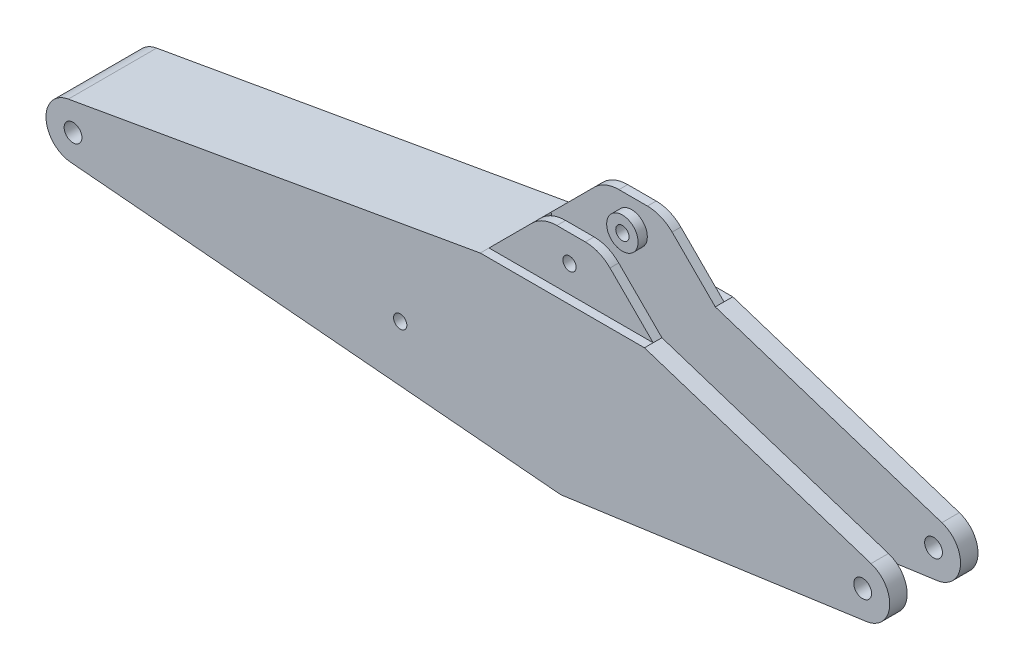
ISO-10303-21;
HEADER;
FILE_DESCRIPTION(('STEP AP214'),'2;1');
FILE_NAME('part.step','',(''),(''),'','','');
FILE_SCHEMA(('AUTOMOTIVE_DESIGN { 1 0 10303 214 1 1 1 1 }'));
ENDSEC;
DATA;
#1=APPLICATION_CONTEXT('core data for automotive mechanical design processes');
#2=APPLICATION_PROTOCOL_DEFINITION('international standard','automotive_design',2000,#1);
#3=PRODUCT_CONTEXT('',#1,'mechanical');
#4=PRODUCT('Part','Part','',(#3));
#5=PRODUCT_RELATED_PRODUCT_CATEGORY('part','',(#4));
#6=PRODUCT_DEFINITION_FORMATION('','',#4);
#7=PRODUCT_DEFINITION_CONTEXT('part definition',#1,'design');
#8=PRODUCT_DEFINITION('design','',#6,#7);
#9=PRODUCT_DEFINITION_SHAPE('','',#8);
#10=(LENGTH_UNIT() NAMED_UNIT(*) SI_UNIT(.MILLI.,.METRE.));
#11=(NAMED_UNIT(*) PLANE_ANGLE_UNIT() SI_UNIT($,.RADIAN.));
#12=(NAMED_UNIT(*) SI_UNIT($,.STERADIAN.) SOLID_ANGLE_UNIT());
#13=UNCERTAINTY_MEASURE_WITH_UNIT(LENGTH_MEASURE(1.E-05),#10,'distance_accuracy_value','');
#14=(GEOMETRIC_REPRESENTATION_CONTEXT(3) GLOBAL_UNCERTAINTY_ASSIGNED_CONTEXT((#13)) GLOBAL_UNIT_ASSIGNED_CONTEXT((#10,
#11,#12)) REPRESENTATION_CONTEXT('',''));
#15=CARTESIAN_POINT('',(0.,0.,0.));
#16=DIRECTION('',(0.,0.,1.));
#17=DIRECTION('',(1.,0.,0.));
#18=AXIS2_PLACEMENT_3D('',#15,#16,#17);
#19=CARTESIAN_POINT('',(524.272543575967,524.272543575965,253.));
#20=DIRECTION('',(-0.707106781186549,-0.707106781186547,0.));
#21=DIRECTION('',(0.707106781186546,-0.707106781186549,0.));
#22=AXIS2_PLACEMENT_3D('',#19,#20,#21);
#23=PLANE('',#22);
#24=DIRECTION('',(0.707106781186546,-0.707106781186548,0.));
#25=VECTOR('',#24,1.);
#26=CARTESIAN_POINT('',(479.545087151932,569.,203.));
#27=LINE('',#26,#25);
#28=CARTESIAN_POINT('',(232.123730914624,816.421356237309,203.));
#29=VERTEX_POINT('',#28);
#30=CARTESIAN_POINT('',(479.545087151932,569.,203.));
#31=VERTEX_POINT('',#30);
#32=EDGE_CURVE('E53',#29,#31,#27,.T.);
#33=ORIENTED_EDGE('',*,*,#32,.T.);
#34=DIRECTION('',(0.,0.,-1.));
#35=VECTOR('',#34,1.);
#36=CARTESIAN_POINT('',(479.545087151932,569.,253.));
#37=LINE('',#36,#35);
#38=CARTESIAN_POINT('',(479.545087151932,569.,153.));
#39=VERTEX_POINT('',#38);
#40=EDGE_CURVE('E299',#31,#39,#37,.T.);
#41=ORIENTED_EDGE('',*,*,#40,.T.);
#42=DIRECTION('',(-0.707106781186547,0.707106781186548,0.));
#43=VECTOR('',#42,1.);
#44=CARTESIAN_POINT('',(524.272543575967,524.272543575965,153.));
#45=LINE('',#44,#43);
#46=CARTESIAN_POINT('',(232.123730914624,816.421356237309,153.));
#47=VERTEX_POINT('',#46);
#48=EDGE_CURVE('E287',#39,#47,#45,.T.);
#49=ORIENTED_EDGE('',*,*,#48,.T.);
#50=DIRECTION('',(0.,0.,-1.));
#51=VECTOR('',#50,1.);
#52=CARTESIAN_POINT('',(232.123730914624,816.421356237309,253.));
#53=LINE('',#52,#51);
#54=EDGE_CURVE('E242',#47,#29,#53,.F.);
#55=ORIENTED_EDGE('',*,*,#54,.T.);
#56=EDGE_LOOP('',(#33,#41,#49,#55));
#57=FACE_BOUND('',#56,.T.);
#58=ADVANCED_FACE('F37',(#57),#23,.F.);
#59=CARTESIAN_POINT('',(0.,875.,253.));
#60=DIRECTION('',(0.,-1.,0.));
#61=DIRECTION('',(0.,0.,-1.));
#62=AXIS2_PLACEMENT_3D('',#59,#60,#61);
#63=PLANE('',#62);
#64=DIRECTION('',(1.,0.,0.));
#65=VECTOR('',#64,1.);
#66=CARTESIAN_POINT('',(90.7023746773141,875.,203.));
#67=LINE('',#66,#65);
#68=CARTESIAN_POINT('',(-72.4067972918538,875.,203.));
#69=VERTEX_POINT('',#68);
#70=CARTESIAN_POINT('',(90.7023746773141,875.,203.));
#71=VERTEX_POINT('',#70);
#72=EDGE_CURVE('E219',#69,#71,#67,.T.);
#73=ORIENTED_EDGE('',*,*,#72,.T.);
#74=DIRECTION('',(0.,0.,-1.));
#75=VECTOR('',#74,1.);
#76=CARTESIAN_POINT('',(90.7023746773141,875.,253.));
#77=LINE('',#76,#75);
#78=CARTESIAN_POINT('',(90.7023746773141,875.,153.));
#79=VERTEX_POINT('',#78);
#80=EDGE_CURVE('E61',#71,#79,#77,.T.);
#81=ORIENTED_EDGE('',*,*,#80,.T.);
#82=DIRECTION('',(-1.,0.,0.));
#83=VECTOR('',#82,1.);
#84=CARTESIAN_POINT('',(0.,875.,153.));
#85=LINE('',#84,#83);
#86=CARTESIAN_POINT('',(-72.4067972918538,875.,153.));
#87=VERTEX_POINT('',#86);
#88=EDGE_CURVE('E485',#79,#87,#85,.T.);
#89=ORIENTED_EDGE('',*,*,#88,.T.);
#90=DIRECTION('',(0.,0.,-1.));
#91=VECTOR('',#90,1.);
#92=CARTESIAN_POINT('',(-72.4067972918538,875.,253.));
#93=LINE('',#92,#91);
#94=EDGE_CURVE('E228',#87,#69,#93,.F.);
#95=ORIENTED_EDGE('',*,*,#94,.T.);
#96=EDGE_LOOP('',(#73,#81,#89,#95));
#97=FACE_BOUND('',#96,.T.);
#98=ADVANCED_FACE('F226',(#97),#63,.F.);
#99=CARTESIAN_POINT('',(-515.124754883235,515.124754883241,253.));
#100=DIRECTION('',(0.707106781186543,-0.707106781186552,0.));
#101=DIRECTION('',(0.707106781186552,0.707106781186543,0.));
#102=AXIS2_PLACEMENT_3D('',#99,#100,#101);
#103=PLANE('',#102);
#104=DIRECTION('',(0.707106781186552,0.707106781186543,0.));
#105=VECTOR('',#104,1.);
#106=CARTESIAN_POINT('',(-213.828153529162,816.42135623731,203.));
#107=LINE('',#106,#105);
#108=CARTESIAN_POINT('',(-461.249509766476,569.,203.));
#109=VERTEX_POINT('',#108);
#110=CARTESIAN_POINT('',(-213.828153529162,816.42135623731,203.));
#111=VERTEX_POINT('',#110);
#112=EDGE_CURVE('E539',#109,#111,#107,.T.);
#113=ORIENTED_EDGE('',*,*,#112,.T.);
#114=DIRECTION('',(0.,0.,-1.));
#115=VECTOR('',#114,1.);
#116=CARTESIAN_POINT('',(-213.828153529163,816.42135623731,253.));
#117=LINE('',#116,#115);
#118=CARTESIAN_POINT('',(-213.828153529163,816.42135623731,153.));
#119=VERTEX_POINT('',#118);
#120=EDGE_CURVE('E238',#111,#119,#117,.T.);
#121=ORIENTED_EDGE('',*,*,#120,.T.);
#122=DIRECTION('',(-0.707106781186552,-0.707106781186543,0.));
#123=VECTOR('',#122,1.);
#124=CARTESIAN_POINT('',(-515.124754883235,515.124754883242,153.));
#125=LINE('',#124,#123);
#126=CARTESIAN_POINT('',(-461.249509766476,569.,153.));
#127=VERTEX_POINT('',#126);
#128=EDGE_CURVE('E490',#119,#127,#125,.T.);
#129=ORIENTED_EDGE('',*,*,#128,.T.);
#130=DIRECTION('',(0.,0.,-1.));
#131=VECTOR('',#130,1.);
#132=CARTESIAN_POINT('',(-461.249509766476,569.,253.));
#133=LINE('',#132,#131);
#134=EDGE_CURVE('E396',#109,#127,#133,.T.);
#135=ORIENTED_EDGE('',*,*,#134,.F.);
#136=EDGE_LOOP('',(#113,#121,#129,#135));
#137=FACE_BOUND('',#136,.T.);
#138=ADVANCED_FACE('F536',(#137),#103,.F.);
#139=CARTESIAN_POINT('',(0.,0.,253.));
#140=DIRECTION('',(0.,0.,1.));
#141=DIRECTION('',(1.,0.,0.));
#142=AXIS2_PLACEMENT_3D('',#139,#140,#141);
#143=PLANE('',#142);
#144=CARTESIAN_POINT('',(-919.999999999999,0.,253.));
#145=DIRECTION('',(0.,0.,1.));
#146=DIRECTION('',(1.,0.,0.));
#147=AXIS2_PLACEMENT_3D('',#144,#145,#146);
#148=CIRCLE('',#147,38.);
#149=CARTESIAN_POINT('',(-881.999999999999,0.,253.));
#150=VERTEX_POINT('',#149);
#151=EDGE_CURVE('E687',#150,#150,#148,.T.);
#152=ORIENTED_EDGE('',*,*,#151,.F.);
#153=EDGE_LOOP('',(#152));
#154=FACE_BOUND('',#153,.T.);
#155=CARTESIAN_POINT('',(1730.,0.,253.));
#156=DIRECTION('',(0.,0.,1.));
#157=DIRECTION('',(1.,0.,0.));
#158=AXIS2_PLACEMENT_3D('',#155,#156,#157);
#159=CIRCLE('',#158,51.0000000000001);
#160=CARTESIAN_POINT('',(1781.,0.,253.));
#161=VERTEX_POINT('',#160);
#162=EDGE_CURVE('E360',#161,#161,#159,.T.);
#163=ORIENTED_EDGE('',*,*,#162,.F.);
#164=EDGE_LOOP('',(#163));
#165=FACE_BOUND('',#164,.T.);
#166=CARTESIAN_POINT('',(-2795.,0.,253.));
#167=DIRECTION('',(0.,0.,1.));
#168=DIRECTION('',(1.,0.,0.));
#169=AXIS2_PLACEMENT_3D('',#166,#167,#168);
#170=CIRCLE('',#169,51.0000000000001);
#171=CARTESIAN_POINT('',(-2744.,0.,253.));
#172=VERTEX_POINT('',#171);
#173=EDGE_CURVE('E357',#172,#172,#170,.T.);
#174=ORIENTED_EDGE('',*,*,#173,.F.);
#175=EDGE_LOOP('',(#174));
#176=FACE_BOUND('',#175,.T.);
#177=DIRECTION('',(-0.951115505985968,0.308835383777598,0.));
#178=VECTOR('',#177,1.);
#179=CARTESIAN_POINT('',(212.875663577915,655.589855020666,253.));
#180=LINE('',#179,#178);
#181=CARTESIAN_POINT('',(1777.86948448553,147.422903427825,253.));
#182=VERTEX_POINT('',#181);
#183=CARTESIAN_POINT('',(479.545087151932,569.,253.));
#184=VERTEX_POINT('',#183);
#185=EDGE_CURVE('E347',#182,#184,#180,.T.);
#186=ORIENTED_EDGE('',*,*,#185,.T.);
#187=DIRECTION('',(-1.,0.,0.));
#188=VECTOR('',#187,1.);
#189=CARTESIAN_POINT('',(479.545087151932,569.,253.));
#190=LINE('',#189,#188);
#191=CARTESIAN_POINT('',(-461.249509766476,569.,253.));
#192=VERTEX_POINT('',#191);
#193=EDGE_CURVE('E546',#184,#192,#190,.T.);
#194=ORIENTED_EDGE('',*,*,#193,.T.);
#195=DIRECTION('',(0.984800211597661,0.173690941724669,0.));
#196=VECTOR('',#195,1.);
#197=CARTESIAN_POINT('',(-111.243174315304,630.731231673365,253.));
#198=LINE('',#197,#196);
#199=CARTESIAN_POINT('',(-2821.92209596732,152.644032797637,253.));
#200=VERTEX_POINT('',#199);
#201=EDGE_CURVE('E350',#200,#192,#198,.T.);
#202=ORIENTED_EDGE('',*,*,#201,.F.);
#203=CARTESIAN_POINT('',(-2795.,0.,253.));
#204=DIRECTION('',(0.,0.,1.));
#205=DIRECTION('',(1.,0.,0.));
#206=AXIS2_PLACEMENT_3D('',#203,#204,#205);
#207=CIRCLE('',#206,155.);
#208=CARTESIAN_POINT('',(-2808.50243501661,-154.410764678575,253.));
#209=VERTEX_POINT('',#208);
#210=EDGE_CURVE('E353',#200,#209,#207,.T.);
#211=ORIENTED_EDGE('',*,*,#210,.T.);
#212=DIRECTION('',(0.996198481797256,-0.0871124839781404,0.));
#213=VECTOR('',#212,1.);
#214=CARTESIAN_POINT('',(-34.7125297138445,-396.964566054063,253.));
#215=LINE('',#214,#213);
#216=CARTESIAN_POINT('',(0.,-400.,253.));
#217=VERTEX_POINT('',#216);
#218=EDGE_CURVE('E355',#209,#217,#215,.T.);
#219=ORIENTED_EDGE('',*,*,#218,.T.);
#220=DIRECTION('',(0.990241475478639,0.139362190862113,0.));
#221=VECTOR('',#220,1.);
#222=CARTESIAN_POINT('',(55.2008886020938,-392.231271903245,253.));
#223=LINE('',#222,#221);
#224=CARTESIAN_POINT('',(1751.60113958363,-153.487428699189,253.));
#225=VERTEX_POINT('',#224);
#226=EDGE_CURVE('E341',#217,#225,#223,.T.);
#227=ORIENTED_EDGE('',*,*,#226,.T.);
#228=CARTESIAN_POINT('',(1730.,0.,253.));
#229=DIRECTION('',(0.,0.,1.));
#230=DIRECTION('',(1.,0.,0.));
#231=AXIS2_PLACEMENT_3D('',#228,#229,#230);
#232=CIRCLE('',#231,155.);
#233=EDGE_CURVE('E344',#225,#182,#232,.T.);
#234=ORIENTED_EDGE('',*,*,#233,.T.);
#235=EDGE_LOOP('',(#186,#194,#202,#211,#219,#227,#234));
#236=FACE_BOUND('',#235,.T.);
#237=ADVANCED_FACE('F739',(#154,#165,#176,#236),#143,.T.);
#238=CARTESIAN_POINT('',(-72.4067972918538,675.,253.));
#239=DIRECTION('',(0.,0.,-1.));
#240=DIRECTION('',(-1.,0.,0.));
#241=AXIS2_PLACEMENT_3D('',#238,#239,#240);
#242=CYLINDRICAL_SURFACE('',#241,200.);
#243=ORIENTED_EDGE('',*,*,#120,.F.);
#244=CARTESIAN_POINT('',(-72.4067972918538,675.,203.));
#245=DIRECTION('',(0.,0.,-1.));
#246=DIRECTION('',(-1.,0.,0.));
#247=AXIS2_PLACEMENT_3D('',#244,#245,#246);
#248=CIRCLE('',#247,200.);
#249=EDGE_CURVE('E229',#111,#69,#248,.T.);
#250=ORIENTED_EDGE('',*,*,#249,.T.);
#251=ORIENTED_EDGE('',*,*,#94,.F.);
#252=CARTESIAN_POINT('',(-72.4067972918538,675.,153.));
#253=DIRECTION('',(0.,0.,1.));
#254=DIRECTION('',(1.,0.,0.));
#255=AXIS2_PLACEMENT_3D('',#252,#253,#254);
#256=CIRCLE('',#255,200.);
#257=EDGE_CURVE('E487',#87,#119,#256,.T.);
#258=ORIENTED_EDGE('',*,*,#257,.T.);
#259=EDGE_LOOP('',(#243,#250,#251,#258));
#260=FACE_BOUND('',#259,.T.);
#261=ADVANCED_FACE('F541',(#260),#242,.T.);
#262=CARTESIAN_POINT('',(90.7023746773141,675.,253.));
#263=DIRECTION('',(0.,0.,-1.));
#264=DIRECTION('',(-1.,0.,0.));
#265=AXIS2_PLACEMENT_3D('',#262,#263,#264);
#266=CYLINDRICAL_SURFACE('',#265,200.);
#267=ORIENTED_EDGE('',*,*,#80,.F.);
#268=CARTESIAN_POINT('',(90.7023746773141,675.,203.));
#269=DIRECTION('',(0.,0.,-1.));
#270=DIRECTION('',(-1.,0.,0.));
#271=AXIS2_PLACEMENT_3D('',#268,#269,#270);
#272=CIRCLE('',#271,200.);
#273=EDGE_CURVE('E216',#71,#29,#272,.T.);
#274=ORIENTED_EDGE('',*,*,#273,.T.);
#275=ORIENTED_EDGE('',*,*,#54,.F.);
#276=CARTESIAN_POINT('',(90.7023746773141,675.,153.));
#277=DIRECTION('',(0.,0.,1.));
#278=DIRECTION('',(1.,0.,0.));
#279=AXIS2_PLACEMENT_3D('',#276,#277,#278);
#280=CIRCLE('',#279,200.);
#281=EDGE_CURVE('E232',#47,#79,#280,.T.);
#282=ORIENTED_EDGE('',*,*,#281,.T.);
#283=EDGE_LOOP('',(#267,#274,#275,#282));
#284=FACE_BOUND('',#283,.T.);
#285=ADVANCED_FACE('F39',(#284),#266,.T.);
#286=CARTESIAN_POINT('',(0.,722.,253.));
#287=DIRECTION('',(0.,0.,-1.));
#288=DIRECTION('',(-1.,0.,0.));
#289=AXIS2_PLACEMENT_3D('',#286,#287,#288);
#290=CYLINDRICAL_SURFACE('',#289,38.);
#291=CARTESIAN_POINT('',(0.,722.,100.));
#292=DIRECTION('',(0.,0.,-1.));
#293=DIRECTION('',(-1.,0.,0.));
#294=AXIS2_PLACEMENT_3D('',#291,#292,#293);
#295=CIRCLE('',#294,38.);
#296=CARTESIAN_POINT('',(-38.,722.,100.));
#297=VERTEX_POINT('',#296);
#298=EDGE_CURVE('E254',#297,#297,#295,.T.);
#299=ORIENTED_EDGE('',*,*,#298,.T.);
#300=EDGE_LOOP('',(#299));
#301=FACE_BOUND('',#300,.T.);
#302=CARTESIAN_POINT('',(0.,722.,203.));
#303=DIRECTION('',(0.,0.,1.));
#304=DIRECTION('',(1.,0.,0.));
#305=AXIS2_PLACEMENT_3D('',#302,#303,#304);
#306=CIRCLE('',#305,38.);
#307=CARTESIAN_POINT('',(38.,722.,203.));
#308=VERTEX_POINT('',#307);
#309=EDGE_CURVE('E259',#308,#308,#306,.F.);
#310=ORIENTED_EDGE('',*,*,#309,.F.);
#311=EDGE_LOOP('',(#310));
#312=FACE_BOUND('',#311,.T.);
#313=ADVANCED_FACE('F611',(#301,#312),#290,.F.);
#314=DIRECTION('',(0.707106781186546,-0.707106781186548,0.));
#315=VECTOR('',#314,1.);
#316=CARTESIAN_POINT('',(479.545087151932,569.,-203.));
#317=LINE('',#316,#315);
#318=CARTESIAN_POINT('',(232.123730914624,816.421356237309,-203.));
#319=VERTEX_POINT('',#318);
#320=CARTESIAN_POINT('',(479.545087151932,569.,-203.));
#321=VERTEX_POINT('',#320);
#322=EDGE_CURVE('E550',#319,#321,#317,.T.);
#323=ORIENTED_EDGE('',*,*,#322,.F.);
#324=CARTESIAN_POINT('',(232.123730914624,816.421356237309,-153.));
#325=VERTEX_POINT('',#324);
#326=EDGE_CURVE('E243',#319,#325,#53,.F.);
#327=ORIENTED_EDGE('',*,*,#326,.T.);
#328=DIRECTION('',(-0.707106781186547,0.707106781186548,0.));
#329=VECTOR('',#328,1.);
#330=CARTESIAN_POINT('',(524.272543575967,524.272543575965,-153.));
#331=LINE('',#330,#329);
#332=CARTESIAN_POINT('',(479.545087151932,569.,-153.));
#333=VERTEX_POINT('',#332);
#334=EDGE_CURVE('E303',#333,#325,#331,.T.);
#335=ORIENTED_EDGE('',*,*,#334,.F.);
#336=EDGE_CURVE('E395',#333,#321,#37,.T.);
#337=ORIENTED_EDGE('',*,*,#336,.T.);
#338=EDGE_LOOP('',(#323,#327,#335,#337));
#339=FACE_BOUND('',#338,.T.);
#340=ADVANCED_FACE('F572',(#339),#23,.F.);
#341=DIRECTION('',(1.,0.,0.));
#342=VECTOR('',#341,1.);
#343=CARTESIAN_POINT('',(90.7023746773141,875.,-203.));
#344=LINE('',#343,#342);
#345=CARTESIAN_POINT('',(-72.4067972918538,875.,-203.));
#346=VERTEX_POINT('',#345);
#347=CARTESIAN_POINT('',(90.7023746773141,875.,-203.));
#348=VERTEX_POINT('',#347);
#349=EDGE_CURVE('E559',#346,#348,#344,.T.);
#350=ORIENTED_EDGE('',*,*,#349,.F.);
#351=CARTESIAN_POINT('',(-72.4067972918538,875.,-153.));
#352=VERTEX_POINT('',#351);
#353=EDGE_CURVE('E235',#346,#352,#93,.F.);
#354=ORIENTED_EDGE('',*,*,#353,.T.);
#355=DIRECTION('',(-1.,0.,0.));
#356=VECTOR('',#355,1.);
#357=CARTESIAN_POINT('',(0.,875.,-153.));
#358=LINE('',#357,#356);
#359=CARTESIAN_POINT('',(90.7023746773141,875.,-153.));
#360=VERTEX_POINT('',#359);
#361=EDGE_CURVE('E458',#360,#352,#358,.T.);
#362=ORIENTED_EDGE('',*,*,#361,.F.);
#363=EDGE_CURVE('E233',#360,#348,#77,.T.);
#364=ORIENTED_EDGE('',*,*,#363,.T.);
#365=EDGE_LOOP('',(#350,#354,#362,#364));
#366=FACE_BOUND('',#365,.T.);
#367=ADVANCED_FACE('F581',(#366),#63,.F.);
#368=DIRECTION('',(0.707106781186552,0.707106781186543,0.));
#369=VECTOR('',#368,1.);
#370=CARTESIAN_POINT('',(-213.828153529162,816.42135623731,-203.));
#371=LINE('',#370,#369);
#372=CARTESIAN_POINT('',(-461.249509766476,569.,-203.));
#373=VERTEX_POINT('',#372);
#374=CARTESIAN_POINT('',(-213.828153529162,816.42135623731,-203.));
#375=VERTEX_POINT('',#374);
#376=EDGE_CURVE('E555',#373,#375,#371,.T.);
#377=ORIENTED_EDGE('',*,*,#376,.F.);
#378=CARTESIAN_POINT('',(-461.249509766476,569.,-153.));
#379=VERTEX_POINT('',#378);
#380=EDGE_CURVE('E391',#379,#373,#133,.T.);
#381=ORIENTED_EDGE('',*,*,#380,.F.);
#382=DIRECTION('',(-0.707106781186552,-0.707106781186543,0.));
#383=VECTOR('',#382,1.);
#384=CARTESIAN_POINT('',(-515.124754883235,515.124754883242,-153.));
#385=LINE('',#384,#383);
#386=CARTESIAN_POINT('',(-213.828153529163,816.42135623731,-153.));
#387=VERTEX_POINT('',#386);
#388=EDGE_CURVE('E463',#387,#379,#385,.T.);
#389=ORIENTED_EDGE('',*,*,#388,.F.);
#390=EDGE_CURVE('E404',#387,#375,#117,.T.);
#391=ORIENTED_EDGE('',*,*,#390,.T.);
#392=EDGE_LOOP('',(#377,#381,#389,#391));
#393=FACE_BOUND('',#392,.T.);
#394=ADVANCED_FACE('F591',(#393),#103,.F.);
#395=ORIENTED_EDGE('',*,*,#353,.F.);
#396=CARTESIAN_POINT('',(-72.4067972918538,675.,-203.));
#397=DIRECTION('',(0.,0.,-1.));
#398=DIRECTION('',(-1.,0.,0.));
#399=AXIS2_PLACEMENT_3D('',#396,#397,#398);
#400=CIRCLE('',#399,200.);
#401=EDGE_CURVE('E557',#375,#346,#400,.T.);
#402=ORIENTED_EDGE('',*,*,#401,.F.);
#403=ORIENTED_EDGE('',*,*,#390,.F.);
#404=CARTESIAN_POINT('',(-72.4067972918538,675.,-153.));
#405=DIRECTION('',(0.,0.,1.));
#406=DIRECTION('',(1.,0.,0.));
#407=AXIS2_PLACEMENT_3D('',#404,#405,#406);
#408=CIRCLE('',#407,200.);
#409=EDGE_CURVE('E461',#352,#387,#408,.T.);
#410=ORIENTED_EDGE('',*,*,#409,.F.);
#411=EDGE_LOOP('',(#395,#402,#403,#410));
#412=FACE_BOUND('',#411,.T.);
#413=ADVANCED_FACE('F585',(#412),#242,.T.);
#414=ORIENTED_EDGE('',*,*,#326,.F.);
#415=CARTESIAN_POINT('',(90.7023746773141,675.,-203.));
#416=DIRECTION('',(0.,0.,-1.));
#417=DIRECTION('',(-1.,0.,0.));
#418=AXIS2_PLACEMENT_3D('',#415,#416,#417);
#419=CIRCLE('',#418,200.);
#420=EDGE_CURVE('E445',#348,#319,#419,.T.);
#421=ORIENTED_EDGE('',*,*,#420,.F.);
#422=ORIENTED_EDGE('',*,*,#363,.F.);
#423=CARTESIAN_POINT('',(90.7023746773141,675.,-153.));
#424=DIRECTION('',(0.,0.,1.));
#425=DIRECTION('',(1.,0.,0.));
#426=AXIS2_PLACEMENT_3D('',#423,#424,#425);
#427=CIRCLE('',#426,200.);
#428=EDGE_CURVE('E307',#325,#360,#427,.T.);
#429=ORIENTED_EDGE('',*,*,#428,.F.);
#430=EDGE_LOOP('',(#414,#421,#422,#429));
#431=FACE_BOUND('',#430,.T.);
#432=ADVANCED_FACE('F576',(#431),#266,.T.);
#433=CARTESIAN_POINT('',(0.,722.,-100.));
#434=DIRECTION('',(0.,0.,1.));
#435=DIRECTION('',(1.,0.,0.));
#436=AXIS2_PLACEMENT_3D('',#433,#434,#435);
#437=CIRCLE('',#436,38.);
#438=CARTESIAN_POINT('',(38.,722.,-100.));
#439=VERTEX_POINT('',#438);
#440=EDGE_CURVE('E251',#439,#439,#437,.T.);
#441=ORIENTED_EDGE('',*,*,#440,.T.);
#442=EDGE_LOOP('',(#441));
#443=FACE_BOUND('',#442,.T.);
#444=CARTESIAN_POINT('',(0.,722.,-203.));
#445=DIRECTION('',(0.,0.,-1.));
#446=DIRECTION('',(-1.,0.,0.));
#447=AXIS2_PLACEMENT_3D('',#444,#445,#446);
#448=CIRCLE('',#447,38.);
#449=CARTESIAN_POINT('',(-38.,722.,-203.));
#450=VERTEX_POINT('',#449);
#451=EDGE_CURVE('E255',#450,#450,#448,.F.);
#452=ORIENTED_EDGE('',*,*,#451,.F.);
#453=EDGE_LOOP('',(#452));
#454=FACE_BOUND('',#453,.T.);
#455=ADVANCED_FACE('F618',(#443,#454),#290,.F.);
#456=CARTESIAN_POINT('',(55.2008886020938,-392.231271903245,253.));
#457=DIRECTION('',(-0.139362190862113,0.990241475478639,0.));
#458=DIRECTION('',(-0.990241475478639,-0.139362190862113,0.));
#459=AXIS2_PLACEMENT_3D('',#456,#457,#458);
#460=PLANE('',#459);
#461=DIRECTION('',(0.990241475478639,0.139362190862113,0.));
#462=VECTOR('',#461,1.);
#463=CARTESIAN_POINT('',(55.2008886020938,-392.231271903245,-153.));
#464=LINE('',#463,#462);
#465=CARTESIAN_POINT('',(1024.,-255.886784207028,-153.));
#466=VERTEX_POINT('',#465);
#467=CARTESIAN_POINT('',(1751.60113958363,-153.487428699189,-153.));
#468=VERTEX_POINT('',#467);
#469=EDGE_CURVE('E480',#466,#468,#464,.T.);
#470=ORIENTED_EDGE('',*,*,#469,.F.);
#471=DIRECTION('',(0.,0.,1.));
#472=VECTOR('',#471,1.);
#473=CARTESIAN_POINT('',(1024.,-255.886784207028,-153.));
#474=LINE('',#473,#472);
#475=CARTESIAN_POINT('',(1024.,-255.886784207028,153.));
#476=VERTEX_POINT('',#475);
#477=EDGE_CURVE('E313',#466,#476,#474,.T.);
#478=ORIENTED_EDGE('',*,*,#477,.T.);
#479=DIRECTION('',(0.990241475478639,0.139362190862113,0.));
#480=VECTOR('',#479,1.);
#481=CARTESIAN_POINT('',(55.2008886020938,-392.231271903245,153.));
#482=LINE('',#481,#480);
#483=CARTESIAN_POINT('',(1751.60113958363,-153.487428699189,153.));
#484=VERTEX_POINT('',#483);
#485=EDGE_CURVE('E309',#476,#484,#482,.T.);
#486=ORIENTED_EDGE('',*,*,#485,.T.);
#487=DIRECTION('',(0.,0.,-1.));
#488=VECTOR('',#487,1.);
#489=CARTESIAN_POINT('',(1751.60113958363,-153.487428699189,253.));
#490=LINE('',#489,#488);
#491=EDGE_CURVE('E402',#225,#484,#490,.T.);
#492=ORIENTED_EDGE('',*,*,#491,.F.);
#493=ORIENTED_EDGE('',*,*,#226,.F.);
#494=DIRECTION('',(0.,0.,-1.));
#495=VECTOR('',#494,1.);
#496=CARTESIAN_POINT('',(0.,-400.,253.));
#497=LINE('',#496,#495);
#498=CARTESIAN_POINT('',(0.,-400.,-253.));
#499=VERTEX_POINT('',#498);
#500=EDGE_CURVE('E363',#217,#499,#497,.T.);
#501=ORIENTED_EDGE('',*,*,#500,.T.);
#502=DIRECTION('',(0.990241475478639,0.139362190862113,0.));
#503=VECTOR('',#502,1.);
#504=CARTESIAN_POINT('',(55.2008886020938,-392.231271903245,-253.));
#505=LINE('',#504,#503);
#506=CARTESIAN_POINT('',(1751.60113958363,-153.487428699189,-253.));
#507=VERTEX_POINT('',#506);
#508=EDGE_CURVE('E340',#499,#507,#505,.T.);
#509=ORIENTED_EDGE('',*,*,#508,.T.);
#510=EDGE_CURVE('E401',#468,#507,#490,.T.);
#511=ORIENTED_EDGE('',*,*,#510,.F.);
#512=EDGE_LOOP('',(#470,#478,#486,#492,#493,#501,#509,#511));
#513=FACE_BOUND('',#512,.T.);
#514=ADVANCED_FACE('F424',(#513),#460,.F.);
#515=CARTESIAN_POINT('',(1730.,0.,253.));
#516=DIRECTION('',(0.,0.,-1.));
#517=DIRECTION('',(-1.,0.,0.));
#518=AXIS2_PLACEMENT_3D('',#515,#516,#517);
#519=CYLINDRICAL_SURFACE('',#518,155.);
#520=CARTESIAN_POINT('',(1730.,0.,-153.));
#521=DIRECTION('',(0.,0.,1.));
#522=DIRECTION('',(1.,0.,0.));
#523=AXIS2_PLACEMENT_3D('',#520,#521,#522);
#524=CIRCLE('',#523,155.);
#525=CARTESIAN_POINT('',(1777.86948448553,147.422903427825,-153.));
#526=VERTEX_POINT('',#525);
#527=EDGE_CURVE('E415',#468,#526,#524,.T.);
#528=ORIENTED_EDGE('',*,*,#527,.F.);
#529=ORIENTED_EDGE('',*,*,#510,.T.);
#530=CARTESIAN_POINT('',(1730.,0.,-253.));
#531=DIRECTION('',(0.,0.,1.));
#532=DIRECTION('',(1.,0.,0.));
#533=AXIS2_PLACEMENT_3D('',#530,#531,#532);
#534=CIRCLE('',#533,155.);
#535=CARTESIAN_POINT('',(1777.86948448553,147.422903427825,-253.));
#536=VERTEX_POINT('',#535);
#537=EDGE_CURVE('E366',#507,#536,#534,.T.);
#538=ORIENTED_EDGE('',*,*,#537,.T.);
#539=DIRECTION('',(0.,0.,-1.));
#540=VECTOR('',#539,1.);
#541=CARTESIAN_POINT('',(1777.86948448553,147.422903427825,253.));
#542=LINE('',#541,#540);
#543=EDGE_CURVE('E400',#526,#536,#542,.T.);
#544=ORIENTED_EDGE('',*,*,#543,.F.);
#545=EDGE_LOOP('',(#528,#529,#538,#544));
#546=FACE_BOUND('',#545,.T.);
#547=ADVANCED_FACE('F412',(#546),#519,.T.);
#548=CARTESIAN_POINT('',(212.875663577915,655.589855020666,253.));
#549=DIRECTION('',(-0.308835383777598,-0.951115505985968,0.));
#550=DIRECTION('',(0.951115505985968,-0.308835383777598,0.));
#551=AXIS2_PLACEMENT_3D('',#548,#549,#550);
#552=PLANE('',#551);
#553=DIRECTION('',(-0.951115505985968,0.308835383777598,0.));
#554=VECTOR('',#553,1.);
#555=CARTESIAN_POINT('',(212.875663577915,655.589855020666,-153.));
#556=LINE('',#555,#554);
#557=EDGE_CURVE('E331',#526,#333,#556,.T.);
#558=ORIENTED_EDGE('',*,*,#557,.F.);
#559=ORIENTED_EDGE('',*,*,#543,.T.);
#560=DIRECTION('',(-0.951115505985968,0.308835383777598,0.));
#561=VECTOR('',#560,1.);
#562=CARTESIAN_POINT('',(212.875663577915,655.589855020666,-253.));
#563=LINE('',#562,#561);
#564=CARTESIAN_POINT('',(479.545087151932,569.,-253.));
#565=VERTEX_POINT('',#564);
#566=EDGE_CURVE('E369',#536,#565,#563,.T.);
#567=ORIENTED_EDGE('',*,*,#566,.T.);
#568=DIRECTION('',(0.,0.,-1.));
#569=VECTOR('',#568,1.);
#570=CARTESIAN_POINT('',(479.545087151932,569.,-203.));
#571=LINE('',#570,#569);
#572=EDGE_CURVE('E443',#321,#565,#571,.T.);
#573=ORIENTED_EDGE('',*,*,#572,.F.);
#574=ORIENTED_EDGE('',*,*,#336,.F.);
#575=EDGE_LOOP('',(#558,#559,#567,#573,#574));
#576=FACE_BOUND('',#575,.T.);
#577=ADVANCED_FACE('F723',(#576),#552,.F.);
#578=CARTESIAN_POINT('',(-2795.,0.,253.));
#579=DIRECTION('',(0.,0.,-1.));
#580=DIRECTION('',(-1.,0.,0.));
#581=AXIS2_PLACEMENT_3D('',#578,#579,#580);
#582=CYLINDRICAL_SURFACE('',#581,51.0000000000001);
#583=CARTESIAN_POINT('',(-2795.,0.,-253.));
#584=DIRECTION('',(0.,0.,1.));
#585=DIRECTION('',(1.,0.,0.));
#586=AXIS2_PLACEMENT_3D('',#583,#584,#585);
#587=CIRCLE('',#586,51.0000000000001);
#588=CARTESIAN_POINT('',(-2744.,0.,-253.));
#589=VERTEX_POINT('',#588);
#590=EDGE_CURVE('E379',#589,#589,#587,.T.);
#591=ORIENTED_EDGE('',*,*,#590,.F.);
#592=EDGE_LOOP('',(#591));
#593=FACE_BOUND('',#592,.T.);
#594=CARTESIAN_POINT('',(-2795.,0.,-153.));
#595=DIRECTION('',(0.,0.,1.));
#596=DIRECTION('',(1.,0.,0.));
#597=AXIS2_PLACEMENT_3D('',#594,#595,#596);
#598=CIRCLE('',#597,51.0000000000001);
#599=CARTESIAN_POINT('',(-2744.,0.,-153.));
#600=VERTEX_POINT('',#599);
#601=EDGE_CURVE('E337',#600,#600,#598,.T.);
#602=ORIENTED_EDGE('',*,*,#601,.T.);
#603=EDGE_LOOP('',(#602));
#604=FACE_BOUND('',#603,.T.);
#605=ADVANCED_FACE('F714',(#593,#604),#582,.F.);
#606=CARTESIAN_POINT('',(1730.,0.,253.));
#607=DIRECTION('',(0.,0.,-1.));
#608=DIRECTION('',(-1.,0.,0.));
#609=AXIS2_PLACEMENT_3D('',#606,#607,#608);
#610=CYLINDRICAL_SURFACE('',#609,51.0000000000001);
#611=CARTESIAN_POINT('',(1730.,0.,-253.));
#612=DIRECTION('',(0.,0.,1.));
#613=DIRECTION('',(1.,0.,0.));
#614=AXIS2_PLACEMENT_3D('',#611,#612,#613);
#615=CIRCLE('',#614,51.0000000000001);
#616=CARTESIAN_POINT('',(1781.,0.,-253.));
#617=VERTEX_POINT('',#616);
#618=EDGE_CURVE('E345',#617,#617,#615,.T.);
#619=ORIENTED_EDGE('',*,*,#618,.F.);
#620=EDGE_LOOP('',(#619));
#621=FACE_BOUND('',#620,.T.);
#622=CARTESIAN_POINT('',(1730.,0.,-153.));
#623=DIRECTION('',(0.,0.,1.));
#624=DIRECTION('',(1.,0.,0.));
#625=AXIS2_PLACEMENT_3D('',#622,#623,#624);
#626=CIRCLE('',#625,51.0000000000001);
#627=CARTESIAN_POINT('',(1781.,0.,-153.));
#628=VERTEX_POINT('',#627);
#629=EDGE_CURVE('E334',#628,#628,#626,.T.);
#630=ORIENTED_EDGE('',*,*,#629,.T.);
#631=EDGE_LOOP('',(#630));
#632=FACE_BOUND('',#631,.T.);
#633=ADVANCED_FACE('F711',(#621,#632),#610,.F.);
#634=ORIENTED_EDGE('',*,*,#491,.T.);
#635=CARTESIAN_POINT('',(1730.,0.,153.));
#636=DIRECTION('',(0.,0.,1.));
#637=DIRECTION('',(1.,0.,0.));
#638=AXIS2_PLACEMENT_3D('',#635,#636,#637);
#639=CIRCLE('',#638,155.);
#640=CARTESIAN_POINT('',(1777.86948448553,147.422903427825,153.));
#641=VERTEX_POINT('',#640);
#642=EDGE_CURVE('E304',#484,#641,#639,.T.);
#643=ORIENTED_EDGE('',*,*,#642,.T.);
#644=EDGE_CURVE('E302',#182,#641,#542,.T.);
#645=ORIENTED_EDGE('',*,*,#644,.F.);
#646=ORIENTED_EDGE('',*,*,#233,.F.);
#647=EDGE_LOOP('',(#634,#643,#645,#646));
#648=FACE_BOUND('',#647,.T.);
#649=ADVANCED_FACE('F713',(#648),#519,.T.);
#650=ORIENTED_EDGE('',*,*,#644,.T.);
#651=DIRECTION('',(-0.951115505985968,0.308835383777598,0.));
#652=VECTOR('',#651,1.);
#653=CARTESIAN_POINT('',(212.875663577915,655.589855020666,153.));
#654=LINE('',#653,#652);
#655=EDGE_CURVE('E289',#641,#39,#654,.T.);
#656=ORIENTED_EDGE('',*,*,#655,.T.);
#657=ORIENTED_EDGE('',*,*,#40,.F.);
#658=EDGE_CURVE('E397',#184,#31,#37,.T.);
#659=ORIENTED_EDGE('',*,*,#658,.F.);
#660=ORIENTED_EDGE('',*,*,#185,.F.);
#661=EDGE_LOOP('',(#650,#656,#657,#659,#660));
#662=FACE_BOUND('',#661,.T.);
#663=ADVANCED_FACE('F297',(#662),#552,.F.);
#664=CARTESIAN_POINT('',(-111.243174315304,630.731231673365,253.));
#665=DIRECTION('',(-0.173690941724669,0.984800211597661,0.));
#666=DIRECTION('',(-0.984800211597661,-0.173690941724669,0.));
#667=AXIS2_PLACEMENT_3D('',#664,#665,#666);
#668=PLANE('',#667);
#669=DIRECTION('',(0.984800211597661,0.173690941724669,0.));
#670=VECTOR('',#669,1.);
#671=CARTESIAN_POINT('',(-111.243174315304,630.731231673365,-253.));
#672=LINE('',#671,#670);
#673=CARTESIAN_POINT('',(-2821.92209596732,152.644032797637,-253.));
#674=VERTEX_POINT('',#673);
#675=CARTESIAN_POINT('',(-461.249509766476,569.,-253.));
#676=VERTEX_POINT('',#675);
#677=EDGE_CURVE('E372',#674,#676,#672,.T.);
#678=ORIENTED_EDGE('',*,*,#677,.F.);
#679=DIRECTION('',(0.,0.,-1.));
#680=VECTOR('',#679,1.);
#681=CARTESIAN_POINT('',(-2821.92209596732,152.644032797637,253.));
#682=LINE('',#681,#680);
#683=EDGE_CURVE('E389',#200,#674,#682,.T.);
#684=ORIENTED_EDGE('',*,*,#683,.F.);
#685=ORIENTED_EDGE('',*,*,#201,.T.);
#686=EDGE_CURVE('E392',#192,#109,#133,.T.);
#687=ORIENTED_EDGE('',*,*,#686,.T.);
#688=ORIENTED_EDGE('',*,*,#134,.T.);
#689=DIRECTION('',(0.,0.,1.));
#690=VECTOR('',#689,1.);
#691=CARTESIAN_POINT('',(-461.249509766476,569.,-153.));
#692=LINE('',#691,#690);
#693=EDGE_CURVE('E328',#379,#127,#692,.T.);
#694=ORIENTED_EDGE('',*,*,#693,.F.);
#695=ORIENTED_EDGE('',*,*,#380,.T.);
#696=DIRECTION('',(0.,0.,-1.));
#697=VECTOR('',#696,1.);
#698=CARTESIAN_POINT('',(-461.249509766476,569.,-203.));
#699=LINE('',#698,#697);
#700=EDGE_CURVE('E258',#373,#676,#699,.T.);
#701=ORIENTED_EDGE('',*,*,#700,.T.);
#702=EDGE_LOOP('',(#678,#684,#685,#687,#688,#694,#695,#701));
#703=FACE_BOUND('',#702,.T.);
#704=ADVANCED_FACE('F436',(#703),#668,.T.);
#705=CARTESIAN_POINT('',(-2795.,0.,253.));
#706=DIRECTION('',(0.,0.,-1.));
#707=DIRECTION('',(-1.,0.,0.));
#708=AXIS2_PLACEMENT_3D('',#705,#706,#707);
#709=CYLINDRICAL_SURFACE('',#708,155.);
#710=CARTESIAN_POINT('',(-2795.,0.,-253.));
#711=DIRECTION('',(0.,0.,1.));
#712=DIRECTION('',(1.,0.,0.));
#713=AXIS2_PLACEMENT_3D('',#710,#711,#712);
#714=CIRCLE('',#713,155.);
#715=CARTESIAN_POINT('',(-2808.50243501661,-154.410764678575,-253.));
#716=VERTEX_POINT('',#715);
#717=EDGE_CURVE('E375',#674,#716,#714,.T.);
#718=ORIENTED_EDGE('',*,*,#717,.T.);
#719=DIRECTION('',(0.,0.,-1.));
#720=VECTOR('',#719,1.);
#721=CARTESIAN_POINT('',(-2808.50243501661,-154.410764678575,253.));
#722=LINE('',#721,#720);
#723=EDGE_CURVE('E386',#209,#716,#722,.T.);
#724=ORIENTED_EDGE('',*,*,#723,.F.);
#725=ORIENTED_EDGE('',*,*,#210,.F.);
#726=ORIENTED_EDGE('',*,*,#683,.T.);
#727=EDGE_LOOP('',(#718,#724,#725,#726));
#728=FACE_BOUND('',#727,.T.);
#729=ADVANCED_FACE('F747',(#728),#709,.T.);
#730=CARTESIAN_POINT('',(-2795.,0.,153.));
#731=DIRECTION('',(0.,0.,1.));
#732=DIRECTION('',(1.,0.,0.));
#733=AXIS2_PLACEMENT_3D('',#730,#731,#732);
#734=CIRCLE('',#733,51.0000000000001);
#735=CARTESIAN_POINT('',(-2744.,0.,153.));
#736=VERTEX_POINT('',#735);
#737=EDGE_CURVE('E280',#736,#736,#734,.T.);
#738=ORIENTED_EDGE('',*,*,#737,.F.);
#739=EDGE_LOOP('',(#738));
#740=FACE_BOUND('',#739,.T.);
#741=ORIENTED_EDGE('',*,*,#173,.T.);
#742=EDGE_LOOP('',(#741));
#743=FACE_BOUND('',#742,.T.);
#744=ADVANCED_FACE('F726',(#740,#743),#582,.F.);
#745=CARTESIAN_POINT('',(-34.7125297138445,-396.964566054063,253.));
#746=DIRECTION('',(0.0871124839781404,0.996198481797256,0.));
#747=DIRECTION('',(-0.996198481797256,0.0871124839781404,0.));
#748=AXIS2_PLACEMENT_3D('',#745,#746,#747);
#749=PLANE('',#748);
#750=DIRECTION('',(0.996198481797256,-0.0871124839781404,0.));
#751=VECTOR('',#750,1.);
#752=CARTESIAN_POINT('',(-34.7125297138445,-396.964566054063,-253.));
#753=LINE('',#752,#751);
#754=EDGE_CURVE('E377',#716,#499,#753,.T.);
#755=ORIENTED_EDGE('',*,*,#754,.T.);
#756=ORIENTED_EDGE('',*,*,#500,.F.);
#757=ORIENTED_EDGE('',*,*,#218,.F.);
#758=ORIENTED_EDGE('',*,*,#723,.T.);
#759=EDGE_LOOP('',(#755,#756,#757,#758));
#760=FACE_BOUND('',#759,.T.);
#761=ADVANCED_FACE('F429',(#760),#749,.F.);
#762=CARTESIAN_POINT('',(1730.,0.,153.));
#763=DIRECTION('',(0.,0.,1.));
#764=DIRECTION('',(1.,0.,0.));
#765=AXIS2_PLACEMENT_3D('',#762,#763,#764);
#766=CIRCLE('',#765,51.0000000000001);
#767=CARTESIAN_POINT('',(1781.,0.,153.));
#768=VERTEX_POINT('',#767);
#769=EDGE_CURVE('E284',#768,#768,#766,.T.);
#770=ORIENTED_EDGE('',*,*,#769,.F.);
#771=EDGE_LOOP('',(#770));
#772=FACE_BOUND('',#771,.T.);
#773=ORIENTED_EDGE('',*,*,#162,.T.);
#774=EDGE_LOOP('',(#773));
#775=FACE_BOUND('',#774,.T.);
#776=ADVANCED_FACE('F717',(#772,#775),#610,.F.);
#777=CARTESIAN_POINT('',(0.,0.,-253.));
#778=DIRECTION('',(0.,0.,1.));
#779=DIRECTION('',(1.,0.,0.));
#780=AXIS2_PLACEMENT_3D('',#777,#778,#779);
#781=PLANE('',#780);
#782=CARTESIAN_POINT('',(-919.999999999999,0.,-253.));
#783=DIRECTION('',(0.,0.,1.));
#784=DIRECTION('',(1.,0.,0.));
#785=AXIS2_PLACEMENT_3D('',#782,#783,#784);
#786=CIRCLE('',#785,38.);
#787=CARTESIAN_POINT('',(-881.999999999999,0.,-253.));
#788=VERTEX_POINT('',#787);
#789=EDGE_CURVE('E680',#788,#788,#786,.T.);
#790=ORIENTED_EDGE('',*,*,#789,.T.);
#791=EDGE_LOOP('',(#790));
#792=FACE_BOUND('',#791,.T.);
#793=ORIENTED_EDGE('',*,*,#677,.T.);
#794=DIRECTION('',(-1.,0.,0.));
#795=VECTOR('',#794,1.);
#796=CARTESIAN_POINT('',(479.545087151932,569.,-253.));
#797=LINE('',#796,#795);
#798=EDGE_CURVE('E262',#565,#676,#797,.T.);
#799=ORIENTED_EDGE('',*,*,#798,.F.);
#800=ORIENTED_EDGE('',*,*,#566,.F.);
#801=ORIENTED_EDGE('',*,*,#537,.F.);
#802=ORIENTED_EDGE('',*,*,#508,.F.);
#803=ORIENTED_EDGE('',*,*,#754,.F.);
#804=ORIENTED_EDGE('',*,*,#717,.F.);
#805=EDGE_LOOP('',(#793,#799,#800,#801,#802,#803,#804));
#806=FACE_BOUND('',#805,.T.);
#807=ORIENTED_EDGE('',*,*,#590,.T.);
#808=EDGE_LOOP('',(#807));
#809=FACE_BOUND('',#808,.T.);
#810=ORIENTED_EDGE('',*,*,#618,.T.);
#811=EDGE_LOOP('',(#810));
#812=FACE_BOUND('',#811,.T.);
#813=ADVANCED_FACE('F420',(#792,#806,#809,#812),#781,.F.);
#814=CARTESIAN_POINT('',(1024.,0.,-153.));
#815=DIRECTION('',(-1.,0.,0.));
#816=DIRECTION('',(0.,0.,1.));
#817=AXIS2_PLACEMENT_3D('',#814,#815,#816);
#818=PLANE('',#817);
#819=DIRECTION('',(0.,-1.,0.));
#820=VECTOR('',#819,1.);
#821=CARTESIAN_POINT('',(1024.,0.,153.));
#822=LINE('',#821,#820);
#823=CARTESIAN_POINT('',(1024.,-215.492596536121,153.));
#824=VERTEX_POINT('',#823);
#825=EDGE_CURVE('E506',#824,#476,#822,.T.);
#826=ORIENTED_EDGE('',*,*,#825,.T.);
#827=ORIENTED_EDGE('',*,*,#477,.F.);
#828=DIRECTION('',(0.,-1.,0.));
#829=VECTOR('',#828,1.);
#830=CARTESIAN_POINT('',(1024.,0.,-153.));
#831=LINE('',#830,#829);
#832=CARTESIAN_POINT('',(1024.,-215.492596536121,-153.));
#833=VERTEX_POINT('',#832);
#834=EDGE_CURVE('E477',#833,#466,#831,.T.);
#835=ORIENTED_EDGE('',*,*,#834,.F.);
#836=DIRECTION('',(0.,0.,1.));
#837=VECTOR('',#836,1.);
#838=CARTESIAN_POINT('',(1024.,-215.492596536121,-153.));
#839=LINE('',#838,#837);
#840=EDGE_CURVE('E316',#833,#824,#839,.T.);
#841=ORIENTED_EDGE('',*,*,#840,.T.);
#842=EDGE_LOOP('',(#826,#827,#835,#841));
#843=FACE_BOUND('',#842,.T.);
#844=ADVANCED_FACE('F511',(#843),#818,.F.);
#845=CARTESIAN_POINT('',(49.6264009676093,-352.621612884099,-153.));
#846=DIRECTION('',(-0.139362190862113,0.990241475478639,0.));
#847=DIRECTION('',(-0.990241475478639,-0.139362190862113,0.));
#848=AXIS2_PLACEMENT_3D('',#845,#846,#847);
#849=PLANE('',#848);
#850=DIRECTION('',(-0.990241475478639,-0.139362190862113,0.));
#851=VECTOR('',#850,1.);
#852=CARTESIAN_POINT('',(49.6264009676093,-352.621612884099,153.));
#853=LINE('',#852,#851);
#854=CARTESIAN_POINT('',(-1.05857734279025,-359.754791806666,153.));
#855=VERTEX_POINT('',#854);
#856=EDGE_CURVE('E504',#824,#855,#853,.T.);
#857=ORIENTED_EDGE('',*,*,#856,.F.);
#858=ORIENTED_EDGE('',*,*,#840,.F.);
#859=DIRECTION('',(-0.990241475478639,-0.139362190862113,0.));
#860=VECTOR('',#859,1.);
#861=CARTESIAN_POINT('',(49.6264009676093,-352.621612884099,-153.));
#862=LINE('',#861,#860);
#863=CARTESIAN_POINT('',(-1.05857734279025,-359.754791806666,-153.));
#864=VERTEX_POINT('',#863);
#865=EDGE_CURVE('E475',#833,#864,#862,.T.);
#866=ORIENTED_EDGE('',*,*,#865,.T.);
#867=DIRECTION('',(0.,0.,1.));
#868=VECTOR('',#867,1.);
#869=CARTESIAN_POINT('',(-1.05857734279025,-359.754791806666,-153.));
#870=LINE('',#869,#868);
#871=EDGE_CURVE('E318',#864,#855,#870,.T.);
#872=ORIENTED_EDGE('',*,*,#871,.T.);
#873=EDGE_LOOP('',(#857,#858,#866,#872));
#874=FACE_BOUND('',#873,.T.);
#875=ADVANCED_FACE('F516',(#874),#849,.T.);
#876=CARTESIAN_POINT('',(-31.2280303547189,-357.116626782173,-153.));
#877=DIRECTION('',(0.0871124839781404,0.996198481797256,0.));
#878=DIRECTION('',(-0.996198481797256,0.0871124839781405,0.));
#879=AXIS2_PLACEMENT_3D('',#876,#877,#878);
#880=PLANE('',#879);
#881=DIRECTION('',(-0.996198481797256,0.0871124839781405,0.));
#882=VECTOR('',#881,1.);
#883=CARTESIAN_POINT('',(-31.2280303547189,-357.116626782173,153.));
#884=LINE('',#883,#882);
#885=CARTESIAN_POINT('',(-2805.01793565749,-114.562825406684,153.));
#886=VERTEX_POINT('',#885);
#887=EDGE_CURVE('E501',#855,#886,#884,.T.);
#888=ORIENTED_EDGE('',*,*,#887,.F.);
#889=ORIENTED_EDGE('',*,*,#871,.F.);
#890=DIRECTION('',(-0.996198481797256,0.0871124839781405,0.));
#891=VECTOR('',#890,1.);
#892=CARTESIAN_POINT('',(-31.2280303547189,-357.116626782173,-153.));
#893=LINE('',#892,#891);
#894=CARTESIAN_POINT('',(-2805.01793565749,-114.562825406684,-153.));
#895=VERTEX_POINT('',#894);
#896=EDGE_CURVE('E473',#864,#895,#893,.T.);
#897=ORIENTED_EDGE('',*,*,#896,.T.);
#898=DIRECTION('',(0.,0.,1.));
#899=VECTOR('',#898,1.);
#900=CARTESIAN_POINT('',(-2805.01793565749,-114.562825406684,-153.));
#901=LINE('',#900,#899);
#902=EDGE_CURVE('E321',#895,#886,#901,.T.);
#903=ORIENTED_EDGE('',*,*,#902,.T.);
#904=EDGE_LOOP('',(#888,#889,#897,#903));
#905=FACE_BOUND('',#904,.T.);
#906=ADVANCED_FACE('F594',(#905),#880,.T.);
#907=CARTESIAN_POINT('',(-2795.,0.,-153.));
#908=DIRECTION('',(0.,0.,1.));
#909=DIRECTION('',(1.,0.,0.));
#910=AXIS2_PLACEMENT_3D('',#907,#908,#909);
#911=CYLINDRICAL_SURFACE('',#910,115.);
#912=CARTESIAN_POINT('',(-2795.,0.,153.));
#913=DIRECTION('',(0.,0.,1.));
#914=DIRECTION('',(1.,0.,0.));
#915=AXIS2_PLACEMENT_3D('',#912,#913,#914);
#916=CIRCLE('',#915,115.);
#917=CARTESIAN_POINT('',(-2814.97445829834,113.252024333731,153.));
#918=VERTEX_POINT('',#917);
#919=EDGE_CURVE('E498',#918,#886,#916,.T.);
#920=ORIENTED_EDGE('',*,*,#919,.T.);
#921=ORIENTED_EDGE('',*,*,#902,.F.);
#922=CARTESIAN_POINT('',(-2795.,0.,-153.));
#923=DIRECTION('',(0.,0.,1.));
#924=DIRECTION('',(1.,0.,0.));
#925=AXIS2_PLACEMENT_3D('',#922,#923,#924);
#926=CIRCLE('',#925,115.);
#927=CARTESIAN_POINT('',(-2814.97445829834,113.252024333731,-153.));
#928=VERTEX_POINT('',#927);
#929=EDGE_CURVE('E470',#928,#895,#926,.T.);
#930=ORIENTED_EDGE('',*,*,#929,.F.);
#931=DIRECTION('',(0.,0.,1.));
#932=VECTOR('',#931,1.);
#933=CARTESIAN_POINT('',(-2814.97445829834,113.252024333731,-153.));
#934=LINE('',#933,#932);
#935=EDGE_CURVE('E323',#928,#918,#934,.T.);
#936=ORIENTED_EDGE('',*,*,#935,.T.);
#937=EDGE_LOOP('',(#920,#921,#930,#936));
#938=FACE_BOUND('',#937,.T.);
#939=ADVANCED_FACE('F523',(#938),#911,.F.);
#940=CARTESIAN_POINT('',(-104.295536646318,591.339223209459,-153.));
#941=DIRECTION('',(0.173690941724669,-0.984800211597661,0.));
#942=DIRECTION('',(0.984800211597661,0.173690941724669,0.));
#943=AXIS2_PLACEMENT_3D('',#940,#941,#942);
#944=PLANE('',#943);
#945=DIRECTION('',(0.984800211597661,0.173690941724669,0.));
#946=VECTOR('',#945,1.);
#947=CARTESIAN_POINT('',(-104.295536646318,591.339223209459,153.));
#948=LINE('',#947,#946);
#949=CARTESIAN_POINT('',(-454.301872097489,529.607991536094,153.));
#950=VERTEX_POINT('',#949);
#951=EDGE_CURVE('E496',#918,#950,#948,.T.);
#952=ORIENTED_EDGE('',*,*,#951,.F.);
#953=ORIENTED_EDGE('',*,*,#935,.F.);
#954=DIRECTION('',(0.984800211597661,0.173690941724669,0.));
#955=VECTOR('',#954,1.);
#956=CARTESIAN_POINT('',(-104.295536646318,591.339223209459,-153.));
#957=LINE('',#956,#955);
#958=CARTESIAN_POINT('',(-454.301872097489,529.607991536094,-153.));
#959=VERTEX_POINT('',#958);
#960=EDGE_CURVE('E468',#928,#959,#957,.T.);
#961=ORIENTED_EDGE('',*,*,#960,.T.);
#962=DIRECTION('',(0.,0.,1.));
#963=VECTOR('',#962,1.);
#964=CARTESIAN_POINT('',(-454.301872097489,529.607991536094,-153.));
#965=LINE('',#964,#963);
#966=EDGE_CURVE('E325',#959,#950,#965,.T.);
#967=ORIENTED_EDGE('',*,*,#966,.T.);
#968=EDGE_LOOP('',(#952,#953,#961,#967));
#969=FACE_BOUND('',#968,.T.);
#970=ADVANCED_FACE('F528',(#969),#944,.T.);
#971=CARTESIAN_POINT('',(-350.006335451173,-61.7312316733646,-153.));
#972=DIRECTION('',(0.984800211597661,0.173690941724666,0.));
#973=DIRECTION('',(-0.173690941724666,0.984800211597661,0.));
#974=AXIS2_PLACEMENT_3D('',#971,#972,#973);
#975=PLANE('',#974);
#976=DIRECTION('',(-0.173690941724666,0.984800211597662,0.));
#977=VECTOR('',#976,1.);
#978=CARTESIAN_POINT('',(-350.006335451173,-61.7312316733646,153.));
#979=LINE('',#978,#977);
#980=EDGE_CURVE('E493',#950,#127,#979,.T.);
#981=ORIENTED_EDGE('',*,*,#980,.F.);
#982=ORIENTED_EDGE('',*,*,#966,.F.);
#983=DIRECTION('',(-0.173690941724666,0.984800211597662,0.));
#984=VECTOR('',#983,1.);
#985=CARTESIAN_POINT('',(-350.006335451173,-61.7312316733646,-153.));
#986=LINE('',#985,#984);
#987=EDGE_CURVE('E466',#959,#379,#986,.T.);
#988=ORIENTED_EDGE('',*,*,#987,.T.);
#989=ORIENTED_EDGE('',*,*,#693,.T.);
#990=EDGE_LOOP('',(#981,#982,#988,#989));
#991=FACE_BOUND('',#990,.T.);
#992=ADVANCED_FACE('F592',(#991),#975,.T.);
#993=CARTESIAN_POINT('',(0.,0.,-153.));
#994=DIRECTION('',(0.,0.,1.));
#995=DIRECTION('',(1.,0.,0.));
#996=AXIS2_PLACEMENT_3D('',#993,#994,#995);
#997=PLANE('',#996);
#998=CARTESIAN_POINT('',(-919.999999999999,0.,-153.));
#999=DIRECTION('',(0.,0.,1.));
#1000=DIRECTION('',(1.,0.,0.));
#1001=AXIS2_PLACEMENT_3D('',#998,#999,#1000);
#1002=CIRCLE('',#1001,90.0000000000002);
#1003=CARTESIAN_POINT('',(-829.999999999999,0.,-153.));
#1004=VERTEX_POINT('',#1003);
#1005=EDGE_CURVE('E11',#1004,#1004,#1002,.T.);
#1006=ORIENTED_EDGE('',*,*,#1005,.F.);
#1007=EDGE_LOOP('',(#1006));
#1008=FACE_BOUND('',#1007,.T.);
#1009=CARTESIAN_POINT('',(0.,722.,-153.));
#1010=DIRECTION('',(0.,0.,1.));
#1011=DIRECTION('',(1.,0.,0.));
#1012=AXIS2_PLACEMENT_3D('',#1009,#1010,#1011);
#1013=CIRCLE('',#1012,90.);
#1014=CARTESIAN_POINT('',(90.,722.,-153.));
#1015=VERTEX_POINT('',#1014);
#1016=EDGE_CURVE('E248',#1015,#1015,#1013,.T.);
#1017=ORIENTED_EDGE('',*,*,#1016,.F.);
#1018=EDGE_LOOP('',(#1017));
#1019=FACE_BOUND('',#1018,.T.);
#1020=ORIENTED_EDGE('',*,*,#601,.F.);
#1021=EDGE_LOOP('',(#1020));
#1022=FACE_BOUND('',#1021,.T.);
#1023=ORIENTED_EDGE('',*,*,#629,.F.);
#1024=EDGE_LOOP('',(#1023));
#1025=FACE_BOUND('',#1024,.T.);
#1026=ORIENTED_EDGE('',*,*,#334,.T.);
#1027=ORIENTED_EDGE('',*,*,#428,.T.);
#1028=ORIENTED_EDGE('',*,*,#361,.T.);
#1029=ORIENTED_EDGE('',*,*,#409,.T.);
#1030=ORIENTED_EDGE('',*,*,#388,.T.);
#1031=ORIENTED_EDGE('',*,*,#987,.F.);
#1032=ORIENTED_EDGE('',*,*,#960,.F.);
#1033=ORIENTED_EDGE('',*,*,#929,.T.);
#1034=ORIENTED_EDGE('',*,*,#896,.F.);
#1035=ORIENTED_EDGE('',*,*,#865,.F.);
#1036=ORIENTED_EDGE('',*,*,#834,.T.);
#1037=ORIENTED_EDGE('',*,*,#469,.T.);
#1038=ORIENTED_EDGE('',*,*,#527,.T.);
#1039=ORIENTED_EDGE('',*,*,#557,.T.);
#1040=EDGE_LOOP('',(#1026,#1027,#1028,#1029,#1030,#1031,#1032,#1033,#1034,#1035,#1036,#1037,
#1038,#1039));
#1041=FACE_BOUND('',#1040,.T.);
#1042=ADVANCED_FACE('F273',(#1008,#1019,#1022,#1025,#1041),#997,.T.);
#1043=CARTESIAN_POINT('',(0.,0.,153.));
#1044=DIRECTION('',(0.,0.,1.));
#1045=DIRECTION('',(1.,0.,0.));
#1046=AXIS2_PLACEMENT_3D('',#1043,#1044,#1045);
#1047=PLANE('',#1046);
#1048=CARTESIAN_POINT('',(-919.999999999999,0.,153.));
#1049=DIRECTION('',(0.,0.,1.));
#1050=DIRECTION('',(1.,0.,0.));
#1051=AXIS2_PLACEMENT_3D('',#1048,#1049,#1050);
#1052=CIRCLE('',#1051,90.0000000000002);
#1053=CARTESIAN_POINT('',(-829.999999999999,0.,153.));
#1054=VERTEX_POINT('',#1053);
#1055=EDGE_CURVE('E46',#1054,#1054,#1052,.F.);
#1056=ORIENTED_EDGE('',*,*,#1055,.F.);
#1057=EDGE_LOOP('',(#1056));
#1058=FACE_BOUND('',#1057,.T.);
#1059=CARTESIAN_POINT('',(0.,722.,153.));
#1060=DIRECTION('',(0.,0.,1.));
#1061=DIRECTION('',(1.,0.,0.));
#1062=AXIS2_PLACEMENT_3D('',#1059,#1060,#1061);
#1063=CIRCLE('',#1062,90.);
#1064=CARTESIAN_POINT('',(90.,722.,153.));
#1065=VERTEX_POINT('',#1064);
#1066=EDGE_CURVE('E245',#1065,#1065,#1063,.F.);
#1067=ORIENTED_EDGE('',*,*,#1066,.F.);
#1068=EDGE_LOOP('',(#1067));
#1069=FACE_BOUND('',#1068,.T.);
#1070=ORIENTED_EDGE('',*,*,#737,.T.);
#1071=EDGE_LOOP('',(#1070));
#1072=FACE_BOUND('',#1071,.T.);
#1073=ORIENTED_EDGE('',*,*,#769,.T.);
#1074=EDGE_LOOP('',(#1073));
#1075=FACE_BOUND('',#1074,.T.);
#1076=ORIENTED_EDGE('',*,*,#48,.F.);
#1077=ORIENTED_EDGE('',*,*,#655,.F.);
#1078=ORIENTED_EDGE('',*,*,#642,.F.);
#1079=ORIENTED_EDGE('',*,*,#485,.F.);
#1080=ORIENTED_EDGE('',*,*,#825,.F.);
#1081=ORIENTED_EDGE('',*,*,#856,.T.);
#1082=ORIENTED_EDGE('',*,*,#887,.T.);
#1083=ORIENTED_EDGE('',*,*,#919,.F.);
#1084=ORIENTED_EDGE('',*,*,#951,.T.);
#1085=ORIENTED_EDGE('',*,*,#980,.T.);
#1086=ORIENTED_EDGE('',*,*,#128,.F.);
#1087=ORIENTED_EDGE('',*,*,#257,.F.);
#1088=ORIENTED_EDGE('',*,*,#88,.F.);
#1089=ORIENTED_EDGE('',*,*,#281,.F.);
#1090=EDGE_LOOP('',(#1076,#1077,#1078,#1079,#1080,#1081,#1082,#1083,#1084,#1085,#1086,#1087,
#1088,#1089));
#1091=FACE_BOUND('',#1090,.T.);
#1092=ADVANCED_FACE('F269',(#1058,#1069,#1072,#1075,#1091),#1047,.F.);
#1093=CARTESIAN_POINT('',(0.,722.,100.));
#1094=DIRECTION('',(0.,0.,1.));
#1095=DIRECTION('',(1.,0.,0.));
#1096=AXIS2_PLACEMENT_3D('',#1093,#1094,#1095);
#1097=CYLINDRICAL_SURFACE('',#1096,90.);
#1098=CARTESIAN_POINT('',(0.,722.,100.));
#1099=DIRECTION('',(0.,0.,-1.));
#1100=DIRECTION('',(-1.,0.,0.));
#1101=AXIS2_PLACEMENT_3D('',#1098,#1099,#1100);
#1102=CIRCLE('',#1101,90.);
#1103=CARTESIAN_POINT('',(-90.,722.,100.));
#1104=VERTEX_POINT('',#1103);
#1105=EDGE_CURVE('E292',#1104,#1104,#1102,.T.);
#1106=ORIENTED_EDGE('',*,*,#1105,.F.);
#1107=EDGE_LOOP('',(#1106));
#1108=FACE_BOUND('',#1107,.T.);
#1109=ORIENTED_EDGE('',*,*,#1066,.T.);
#1110=EDGE_LOOP('',(#1109));
#1111=FACE_BOUND('',#1110,.T.);
#1112=ADVANCED_FACE('F272',(#1108,#1111),#1097,.T.);
#1113=CARTESIAN_POINT('',(0.,722.,100.));
#1114=DIRECTION('',(0.,0.,-1.));
#1115=DIRECTION('',(-1.,0.,0.));
#1116=AXIS2_PLACEMENT_3D('',#1113,#1114,#1115);
#1117=PLANE('',#1116);
#1118=ORIENTED_EDGE('',*,*,#298,.F.);
#1119=EDGE_LOOP('',(#1118));
#1120=FACE_BOUND('',#1119,.T.);
#1121=ORIENTED_EDGE('',*,*,#1105,.T.);
#1122=EDGE_LOOP('',(#1121));
#1123=FACE_BOUND('',#1122,.T.);
#1124=ADVANCED_FACE('F915',(#1120,#1123),#1117,.T.);
#1125=CARTESIAN_POINT('',(0.,722.,-100.));
#1126=DIRECTION('',(0.,0.,-1.));
#1127=DIRECTION('',(-1.,0.,0.));
#1128=AXIS2_PLACEMENT_3D('',#1125,#1126,#1127);
#1129=CYLINDRICAL_SURFACE('',#1128,90.);
#1130=CARTESIAN_POINT('',(0.,722.,-100.));
#1131=DIRECTION('',(0.,0.,-1.));
#1132=DIRECTION('',(-1.,0.,0.));
#1133=AXIS2_PLACEMENT_3D('',#1130,#1131,#1132);
#1134=CIRCLE('',#1133,90.);
#1135=CARTESIAN_POINT('',(-90.,722.,-100.));
#1136=VERTEX_POINT('',#1135);
#1137=EDGE_CURVE('E452',#1136,#1136,#1134,.T.);
#1138=ORIENTED_EDGE('',*,*,#1137,.T.);
#1139=EDGE_LOOP('',(#1138));
#1140=FACE_BOUND('',#1139,.T.);
#1141=ORIENTED_EDGE('',*,*,#1016,.T.);
#1142=EDGE_LOOP('',(#1141));
#1143=FACE_BOUND('',#1142,.T.);
#1144=ADVANCED_FACE('F643',(#1140,#1143),#1129,.T.);
#1145=CARTESIAN_POINT('',(0.,722.,-100.));
#1146=DIRECTION('',(0.,0.,1.));
#1147=DIRECTION('',(-1.,0.,0.));
#1148=AXIS2_PLACEMENT_3D('',#1145,#1146,#1147);
#1149=PLANE('',#1148);
#1150=ORIENTED_EDGE('',*,*,#440,.F.);
#1151=EDGE_LOOP('',(#1150));
#1152=FACE_BOUND('',#1151,.T.);
#1153=ORIENTED_EDGE('',*,*,#1137,.F.);
#1154=EDGE_LOOP('',(#1153));
#1155=FACE_BOUND('',#1154,.T.);
#1156=ADVANCED_FACE('F637',(#1152,#1155),#1149,.T.);
#1157=CARTESIAN_POINT('',(90.7023746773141,675.,-203.));
#1158=DIRECTION('',(0.,0.,-1.));
#1159=DIRECTION('',(-1.,0.,0.));
#1160=AXIS2_PLACEMENT_3D('',#1157,#1158,#1159);
#1161=PLANE('',#1160);
#1162=ORIENTED_EDGE('',*,*,#322,.T.);
#1163=DIRECTION('',(-1.,0.,0.));
#1164=VECTOR('',#1163,1.);
#1165=CARTESIAN_POINT('',(479.545087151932,569.,-203.));
#1166=LINE('',#1165,#1164);
#1167=EDGE_CURVE('E553',#321,#373,#1166,.T.);
#1168=ORIENTED_EDGE('',*,*,#1167,.T.);
#1169=ORIENTED_EDGE('',*,*,#376,.T.);
#1170=ORIENTED_EDGE('',*,*,#401,.T.);
#1171=ORIENTED_EDGE('',*,*,#349,.T.);
#1172=ORIENTED_EDGE('',*,*,#420,.T.);
#1173=EDGE_LOOP('',(#1162,#1168,#1169,#1170,#1171,#1172));
#1174=FACE_BOUND('',#1173,.T.);
#1175=ORIENTED_EDGE('',*,*,#451,.T.);
#1176=EDGE_LOOP('',(#1175));
#1177=FACE_BOUND('',#1176,.T.);
#1178=ADVANCED_FACE('F563',(#1174,#1177),#1161,.T.);
#1179=CARTESIAN_POINT('',(479.545087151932,569.,-203.));
#1180=DIRECTION('',(0.,-1.,0.));
#1181=DIRECTION('',(1.,0.,0.));
#1182=AXIS2_PLACEMENT_3D('',#1179,#1180,#1181);
#1183=PLANE('',#1182);
#1184=ORIENTED_EDGE('',*,*,#798,.T.);
#1185=ORIENTED_EDGE('',*,*,#700,.F.);
#1186=ORIENTED_EDGE('',*,*,#1167,.F.);
#1187=ORIENTED_EDGE('',*,*,#572,.T.);
#1188=EDGE_LOOP('',(#1184,#1185,#1186,#1187));
#1189=FACE_BOUND('',#1188,.T.);
#1190=ADVANCED_FACE('F636',(#1189),#1183,.F.);
#1191=CARTESIAN_POINT('',(90.7023746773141,675.,203.));
#1192=DIRECTION('',(0.,0.,1.));
#1193=DIRECTION('',(-1.,0.,0.));
#1194=AXIS2_PLACEMENT_3D('',#1191,#1192,#1193);
#1195=PLANE('',#1194);
#1196=ORIENTED_EDGE('',*,*,#32,.F.);
#1197=ORIENTED_EDGE('',*,*,#273,.F.);
#1198=ORIENTED_EDGE('',*,*,#72,.F.);
#1199=ORIENTED_EDGE('',*,*,#249,.F.);
#1200=ORIENTED_EDGE('',*,*,#112,.F.);
#1201=DIRECTION('',(-1.,0.,0.));
#1202=VECTOR('',#1201,1.);
#1203=CARTESIAN_POINT('',(479.545087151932,569.,203.));
#1204=LINE('',#1203,#1202);
#1205=EDGE_CURVE('E263',#31,#109,#1204,.T.);
#1206=ORIENTED_EDGE('',*,*,#1205,.F.);
#1207=EDGE_LOOP('',(#1196,#1197,#1198,#1199,#1200,#1206));
#1208=FACE_BOUND('',#1207,.T.);
#1209=ORIENTED_EDGE('',*,*,#309,.T.);
#1210=EDGE_LOOP('',(#1209));
#1211=FACE_BOUND('',#1210,.T.);
#1212=ADVANCED_FACE('F217',(#1208,#1211),#1195,.T.);
#1213=CARTESIAN_POINT('',(479.545087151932,569.,203.));
#1214=DIRECTION('',(0.,1.,0.));
#1215=DIRECTION('',(-1.,0.,0.));
#1216=AXIS2_PLACEMENT_3D('',#1213,#1214,#1215);
#1217=PLANE('',#1216);
#1218=ORIENTED_EDGE('',*,*,#193,.F.);
#1219=ORIENTED_EDGE('',*,*,#658,.T.);
#1220=ORIENTED_EDGE('',*,*,#1205,.T.);
#1221=ORIENTED_EDGE('',*,*,#686,.F.);
#1222=EDGE_LOOP('',(#1218,#1219,#1220,#1221));
#1223=FACE_BOUND('',#1222,.T.);
#1224=ADVANCED_FACE('F646',(#1223),#1217,.T.);
#1225=CARTESIAN_POINT('',(-919.999999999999,0.,100.));
#1226=DIRECTION('',(0.,0.,1.));
#1227=DIRECTION('',(1.,0.,0.));
#1228=AXIS2_PLACEMENT_3D('',#1225,#1226,#1227);
#1229=CYLINDRICAL_SURFACE('',#1228,90.0000000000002);
#1230=CARTESIAN_POINT('',(-919.999999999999,0.,100.));
#1231=DIRECTION('',(0.,0.,-1.));
#1232=DIRECTION('',(-1.,0.,0.));
#1233=AXIS2_PLACEMENT_3D('',#1230,#1231,#1232);
#1234=CIRCLE('',#1233,90.0000000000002);
#1235=CARTESIAN_POINT('',(-1010.,0.,100.));
#1236=VERTEX_POINT('',#1235);
#1237=EDGE_CURVE('E549',#1236,#1236,#1234,.T.);
#1238=ORIENTED_EDGE('',*,*,#1237,.F.);
#1239=EDGE_LOOP('',(#1238));
#1240=FACE_BOUND('',#1239,.T.);
#1241=ORIENTED_EDGE('',*,*,#1055,.T.);
#1242=EDGE_LOOP('',(#1241));
#1243=FACE_BOUND('',#1242,.T.);
#1244=ADVANCED_FACE('F267',(#1240,#1243),#1229,.T.);
#1245=CARTESIAN_POINT('',(-919.999999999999,0.,100.));
#1246=DIRECTION('',(0.,0.,-1.));
#1247=DIRECTION('',(-1.,0.,0.));
#1248=AXIS2_PLACEMENT_3D('',#1245,#1246,#1247);
#1249=PLANE('',#1248);
#1250=CARTESIAN_POINT('',(-919.999999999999,0.,100.));
#1251=DIRECTION('',(0.,0.,-1.));
#1252=DIRECTION('',(-1.,0.,0.));
#1253=AXIS2_PLACEMENT_3D('',#1250,#1251,#1252);
#1254=CIRCLE('',#1253,38.);
#1255=CARTESIAN_POINT('',(-958.,0.,100.));
#1256=VERTEX_POINT('',#1255);
#1257=EDGE_CURVE('E683',#1256,#1256,#1254,.T.);
#1258=ORIENTED_EDGE('',*,*,#1257,.F.);
#1259=EDGE_LOOP('',(#1258));
#1260=FACE_BOUND('',#1259,.T.);
#1261=ORIENTED_EDGE('',*,*,#1237,.T.);
#1262=EDGE_LOOP('',(#1261));
#1263=FACE_BOUND('',#1262,.T.);
#1264=ADVANCED_FACE('F654',(#1260,#1263),#1249,.T.);
#1265=CARTESIAN_POINT('',(-919.999999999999,0.,-100.));
#1266=DIRECTION('',(0.,0.,-1.));
#1267=DIRECTION('',(-1.,0.,0.));
#1268=AXIS2_PLACEMENT_3D('',#1265,#1266,#1267);
#1269=CYLINDRICAL_SURFACE('',#1268,90.0000000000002);
#1270=CARTESIAN_POINT('',(-919.999999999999,0.,-100.));
#1271=DIRECTION('',(0.,0.,-1.));
#1272=DIRECTION('',(-1.,0.,0.));
#1273=AXIS2_PLACEMENT_3D('',#1270,#1271,#1272);
#1274=CIRCLE('',#1273,90.0000000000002);
#1275=CARTESIAN_POINT('',(-1010.,0.,-100.));
#1276=VERTEX_POINT('',#1275);
#1277=EDGE_CURVE('E690',#1276,#1276,#1274,.T.);
#1278=ORIENTED_EDGE('',*,*,#1277,.T.);
#1279=EDGE_LOOP('',(#1278));
#1280=FACE_BOUND('',#1279,.T.);
#1281=ORIENTED_EDGE('',*,*,#1005,.T.);
#1282=EDGE_LOOP('',(#1281));
#1283=FACE_BOUND('',#1282,.T.);
#1284=ADVANCED_FACE('F658',(#1280,#1283),#1269,.T.);
#1285=CARTESIAN_POINT('',(-919.999999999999,0.,-100.));
#1286=DIRECTION('',(0.,0.,1.));
#1287=DIRECTION('',(-1.,0.,0.));
#1288=AXIS2_PLACEMENT_3D('',#1285,#1286,#1287);
#1289=PLANE('',#1288);
#1290=CARTESIAN_POINT('',(-919.999999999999,0.,-100.));
#1291=DIRECTION('',(0.,0.,1.));
#1292=DIRECTION('',(1.,0.,0.));
#1293=AXIS2_PLACEMENT_3D('',#1290,#1291,#1292);
#1294=CIRCLE('',#1293,38.);
#1295=CARTESIAN_POINT('',(-881.999999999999,0.,-100.));
#1296=VERTEX_POINT('',#1295);
#1297=EDGE_CURVE('E41',#1296,#1296,#1294,.T.);
#1298=ORIENTED_EDGE('',*,*,#1297,.F.);
#1299=EDGE_LOOP('',(#1298));
#1300=FACE_BOUND('',#1299,.T.);
#1301=ORIENTED_EDGE('',*,*,#1277,.F.);
#1302=EDGE_LOOP('',(#1301));
#1303=FACE_BOUND('',#1302,.T.);
#1304=ADVANCED_FACE('F662',(#1300,#1303),#1289,.T.);
#1305=CARTESIAN_POINT('',(-919.999999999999,0.,-253.));
#1306=DIRECTION('',(0.,0.,1.));
#1307=DIRECTION('',(1.,0.,0.));
#1308=AXIS2_PLACEMENT_3D('',#1305,#1306,#1307);
#1309=CYLINDRICAL_SURFACE('',#1308,38.);
#1310=ORIENTED_EDGE('',*,*,#1297,.T.);
#1311=EDGE_LOOP('',(#1310));
#1312=FACE_BOUND('',#1311,.T.);
#1313=ORIENTED_EDGE('',*,*,#789,.F.);
#1314=EDGE_LOOP('',(#1313));
#1315=FACE_BOUND('',#1314,.T.);
#1316=ADVANCED_FACE('F666',(#1312,#1315),#1309,.F.);
#1317=ORIENTED_EDGE('',*,*,#151,.T.);
#1318=EDGE_LOOP('',(#1317));
#1319=FACE_BOUND('',#1318,.T.);
#1320=ORIENTED_EDGE('',*,*,#1257,.T.);
#1321=EDGE_LOOP('',(#1320));
#1322=FACE_BOUND('',#1321,.T.);
#1323=ADVANCED_FACE('F669',(#1319,#1322),#1309,.F.);
#1324=CLOSED_SHELL('',(#58,#98,#138,#237,#261,#285,#313,#340,#367,#394,#413,#432,#455,#514,#547,
#577,#605,#633,#649,#663,#704,#729,#744,#761,#776,#813,#844,#875,#906,#939,#970,#992,#1042,
#1092,#1112,#1124,#1144,#1156,#1178,#1190,#1212,#1224,#1244,#1264,#1284,#1304,#1316,#1323));
#1325=MANIFOLD_SOLID_BREP('B2',#1324);
#1326=ADVANCED_BREP_SHAPE_REPRESENTATION('',(#18,#1325),#14);
#1327=SHAPE_DEFINITION_REPRESENTATION(#9,#1326);
ENDSEC;
END-ISO-10303-21;
